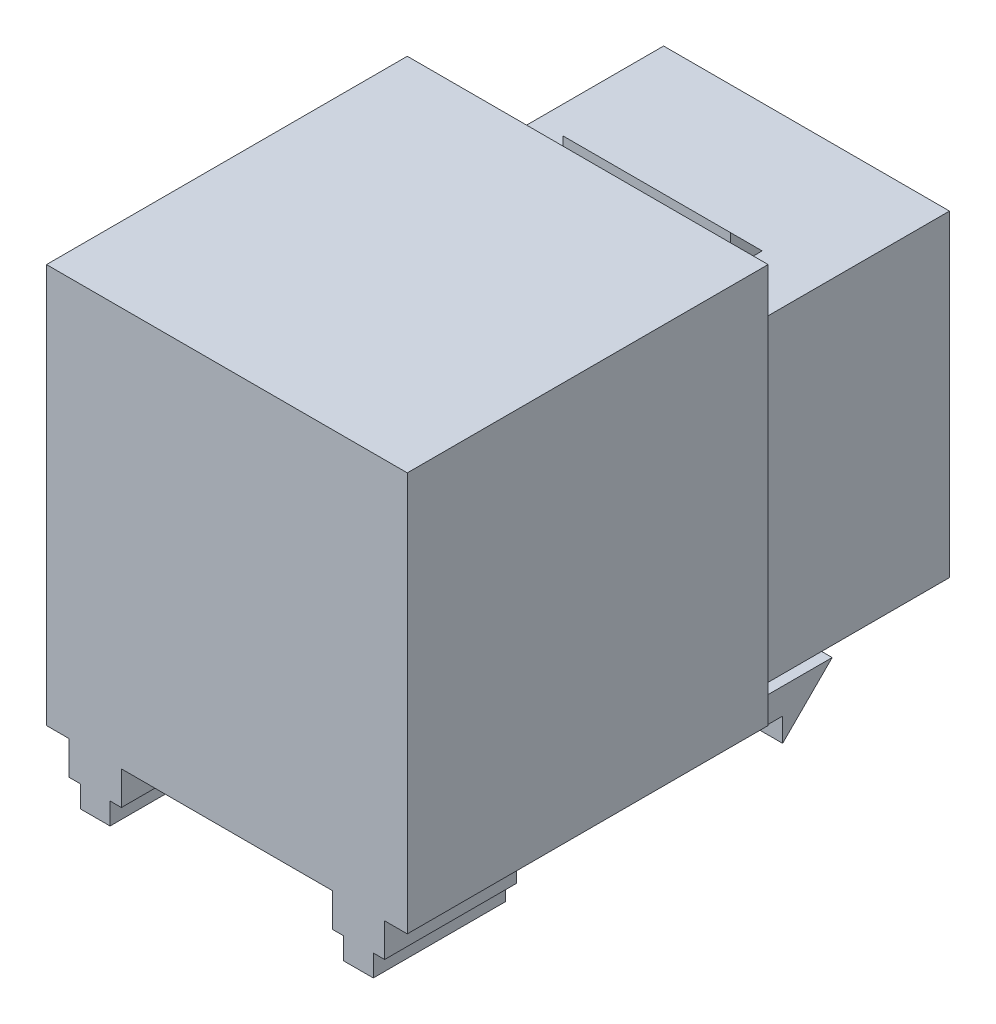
from build123d import *

# Parameters (mm, degrees)
SKIZZE1_W                       = 14.5
SKIZZE1_H                       = 16.1
AUFSATZ_LINEAR_AUSTRAGEN1_DEPTH = 11.1
SKIZZE2_W                       = 18.3
SKIZZE2_H                       = 20.25
AUFSATZ_LINEAR_AUSTRAGEN2_DEPTH = 18.3
AUFSATZ_LINEAR_AUSTRAGEN3_DEPTH = 4.25
AUFSATZ_LINEAR_AUSTRAGEN4_DEPTH = 6
AUFSATZ_LINEAR_AUSTRAGEN5_DEPTH = 6.7


with BuildPart() as part:
    # Skizze1 → Aufsatz-Linear austragen1 (new body)
    with BuildSketch(Plane.XY):
        Rectangle(SKIZZE1_W, SKIZZE1_H)
    extrude(amount=AUFSATZ_LINEAR_AUSTRAGEN1_DEPTH)

    # Skizze2 → Aufsatz-Linear austragen2 (add)
    with BuildSketch(Plane.XY.offset(11.1)):
        with Locations((0, 2.075)):
            Rectangle(SKIZZE2_W, SKIZZE2_H)
    extrude(amount=AUFSATZ_LINEAR_AUSTRAGEN2_DEPTH)

    # Skizze3 → Aufsatz-Linear austragen3 (add, symmetric)
    with BuildSketch(Plane.ZY):
        Polygon((8.1, 8.05), (8.1, 9.65), (6.5, 8.05), align=None)
    extrude(amount=AUFSATZ_LINEAR_AUSTRAGEN3_DEPTH, both=True)

    # Skizze4 → Aufsatz-Linear austragen4 (add, symmetric)
    with BuildSketch(Plane.ZY):
        Polygon((16.8, -8.05), (16.8, -11.15), (7.213562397, -11.15), (7.213562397, -12.35), (4.7, -9.836437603), (14.8, -9.836437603), (14.8, -8.05), align=None)
    extrude(amount=AUFSATZ_LINEAR_AUSTRAGEN4_DEPTH, both=True)

    # Skizze5 → Aufsatz-Linear austragen5 (add)
    with BuildSketch(Plane.XY.offset(22.7)):
        Polygon((-8, -8.05), (-8, -9.75), (-7.425, -9.75), (-7.425, -10.85), (-5.925, -10.85), (-5.925, -9.75), (-5.35, -9.75), (-5.35, -8.05), align=None)
        Polygon((8, -8.05), (5.35, -8.05), (5.35, -9.75), (5.925, -9.75), (5.925, -10.85), (7.425, -10.85), (7.425, -9.75), (8, -9.75), align=None)
    extrude(amount=AUFSATZ_LINEAR_AUSTRAGEN5_DEPTH)


solid = part.part
